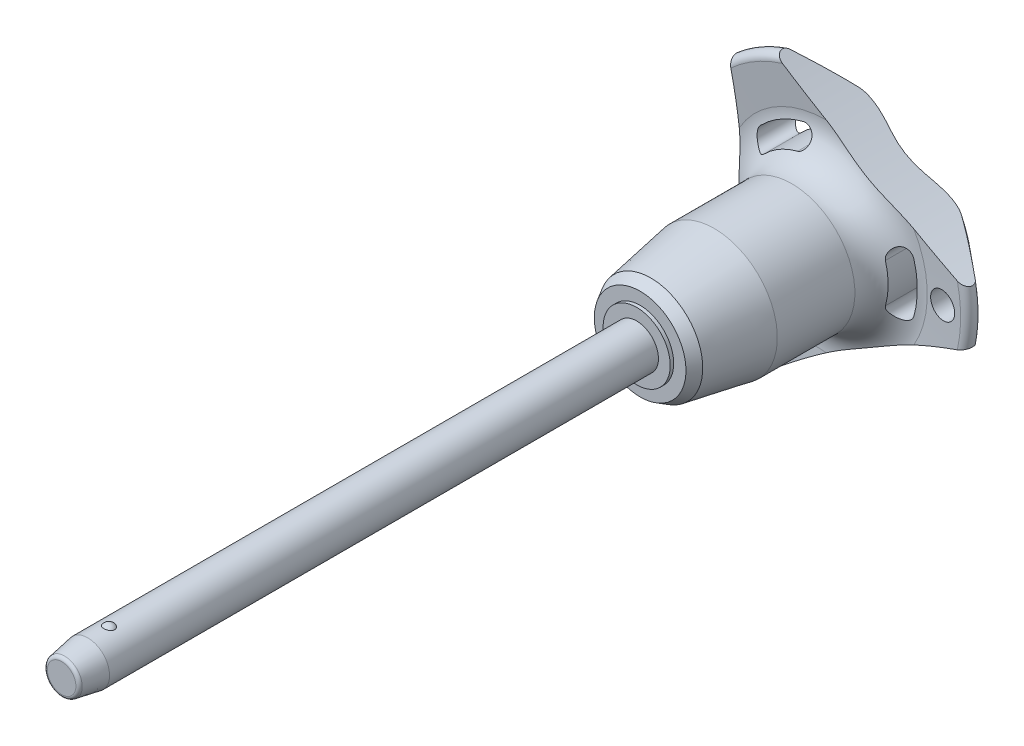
from build123d import *

# Parameters (mm, degrees)
SKETCH1_R           = 2.5
BOSS_EXTRUDE1_DEPTH = 60
SKETCH2_R           = 2.1
BOSS_EXTRUDE2_DEPTH = 26.7
BOSS_EXTRUDE3_START = 6
SKETCH1_2_R         = 2.5
BOSS_EXTRUDE3_DEPTH = 6
CHAMFER1_SIZE       = 3
CHAMFER1_SIZE2      = 0.528980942
FILLET1_R           = 0.4
SKETCH6_R           = 79.96
CUT_EXTRUDE1_DEPTH  = 90.822819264
CIRPATTERN1_COUNT   = 3
SKETCH7_R           = 1.5
CUT_EXTRUDE2_DEPTH  = 90.653203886


with BuildPart() as part:
    # Sketch1 → Boss-Extrude1 (new body)
    with BuildSketch(Plane.XY):
        Circle(SKETCH1_R)
    extrude(amount=-BOSS_EXTRUDE1_DEPTH)

    # Sketch2 → Boss-Extrude2 (add)
    with BuildSketch(Plane(origin=(0, 0, -60), x_dir=(-1, 0, 0), z_dir=(0, 0, -1))):
        Circle(SKETCH2_R)
    extrude(amount=BOSS_EXTRUDE2_DEPTH)

    # Sketch3 → Revolve1 (revolve)
    with BuildSketch(Plane(origin=(0, 0, 0), x_dir=(0, 0, -1), z_dir=(1, 0, 0))):
        with BuildLine():
            Line((-0.580947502, 2.75), (-0.580947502, 1.15))
            ThreePointArc((-0.580947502, 1.15), (0.219052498, 1.95), (-0.580947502, 2.75))
        make_face()
        with BuildLine():
            Line((-0.580947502, -1.15), (-0.580947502, -2.75))
            ThreePointArc((-0.580947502, -2.75), (0.219052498, -1.95), (-0.580947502, -1.15))
        make_face()
    revolve(axis=Axis((0, -1.15, 0.580947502), (0, 1, 0)))

    # Sketch1_2 → Boss-Extrude3 (add)
    with BuildSketch(Plane.XY.offset(BOSS_EXTRUDE3_START)):
        Circle(SKETCH1_2_R)
    extrude(amount=-BOSS_EXTRUDE3_DEPTH)

    # Chamfer1
    chamfer1_edges = [part.edges().sort_by_distance(p)[0] for p in [
        (-2.5, 0, 6),
    ]]
    chamfer1_side = [part.faces().sort_by_distance(p)[0] for p in [
        (-2.5, 0, -27),
    ]]
    chamfer(chamfer1_edges, length=CHAMFER1_SIZE, length2=CHAMFER1_SIZE2, reference=chamfer1_side[0])

    # Fillet1
    fillet1_edges = [part.edges().sort_by_distance(p)[0] for p in [
        (-1.971019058, 0, 6),
        (2.1, 0, -86.7),
    ]]
    fillet(fillet1_edges, radius=FILLET1_R)

    # Sketch4 → Revolve2 (revolve)
    with BuildSketch(Plane(origin=(0, 0, 0), x_dir=(0, 0, -1), z_dir=(1, 0, 0)), mode=Mode.PRIVATE) as revolve2_sk:
        Polygon((60, 0), (60, 3.851837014), (60.4, 3.851837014), (60.4, 5.26161122), (61.620900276, 5.966498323), (68.9, 7.25), (77.8, 7.25), (77.8, 0), align=None)
    revolve(revolve2_sk.sketch.rotate(Axis((0, 0, -77.8), (0, 0, 1)), 90), axis=Axis((0, 0, -77.8), (0, 0, 1)))

    # Sketch5 → Revolve3 (revolve)
    with BuildSketch(Plane(origin=(0, 0, 0), x_dir=(0, 0, -1), z_dir=(1, 0, 0)), mode=Mode.PRIVATE) as revolve3_sk:
        with BuildLine():
            Line((81.78715932, 11.570250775), (81.452568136, 15.735949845))
            ThreePointArc((81.452568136, 15.735949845), (81.946485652, 16.540188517), (82.862835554, 16.314230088))
            Line((82.862835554, 16.314230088), (86.326414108, 12.186497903))
            ThreePointArc((86.326414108, 12.186497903), (86.7, 11.109282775), (86.261488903, 10.056825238))
            ThreePointArc((86.261488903, 10.056825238), (83.289873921, 5.413681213), (82.25, 0))
            Line((82.25, 0), (77.8, 0))
            Line((77.8, 0), (77.8, 7.25))
            ThreePointArc((77.8, 7.25), (80.739473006, 8.537160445), (81.78715932, 11.570250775))
        make_face()
    revolve(revolve3_sk.sketch.rotate(Axis((0, 0, -82.25), (0, 0, 1)), 90), axis=Axis((0, 0, -82.25), (0, 0, 1)))

    # Sketch6 → Cut-Extrude1 (cut, through all)
    with BuildSketch(Plane.XY):
        with Locations((-89.76, 0)):
            Circle(SKETCH6_R)
        with BuildLine():
            ThreePointArc((10.099921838, -2.834717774), (10.490188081, 0), (10.099921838, 2.834717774))
            ThreePointArc((10.099921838, 2.834717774), (8.768180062, 3.582738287), (8.020159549, 2.250996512))
            ThreePointArc((8.020159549, 2.250996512), (8.330062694, 0), (8.020159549, -2.250996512))
            ThreePointArc((8.020159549, -2.250996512), (8.768180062, -3.582738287), (10.099921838, -2.834717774))
        make_face()
    cut_extrude1 = extrude(amount=-CUT_EXTRUDE1_DEPTH, mode=Mode.SUBTRACT)

    # CirPattern1: Cut-Extrude1 ×3 about axis
    cirpattern1_axis = Axis((0, 0, 0), (0, 0, 1))
    for i in range(1, CIRPATTERN1_COUNT):
        add(cut_extrude1.rotate(cirpattern1_axis, i * 360 / CIRPATTERN1_COUNT), mode=Mode.SUBTRACT)

    # Sketch7 → Cut-Extrude2 (cut, through all)
    with BuildSketch(Plane.XY):
        with Locations(Location((13.490188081, 0, 0), (0, 0, 225.221865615))):
            Circle(SKETCH7_R)
    extrude(amount=-CUT_EXTRUDE2_DEPTH, mode=Mode.SUBTRACT)


solid = part.part
